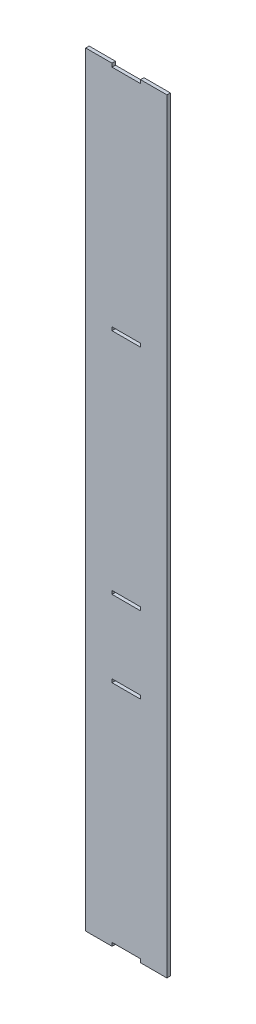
from build123d import *

# Parameters (mm, degrees)
SKETCH1_W           = 12.7
SKETCH1_H           = 1.524
BOSS_EXTRUDE1_DEPTH = 1.524


with BuildPart() as part:
    # Sketch1 → Boss-Extrude1 (new body)
    with BuildSketch(Plane.XY):
        Polygon((-6.35, 338.849599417), (-6.35, 337.325599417), (6.35, 337.325599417), (6.35, 338.849599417), (18.060084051, 338.849599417), (18.060084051, -1.524), (6.35, -1.524), (6.35, 0), (-6.35, 0), (-6.35, -1.524), (-18.060084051, -1.524), (-18.060084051, 338.849599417), align=None)
        with Locations((0, 236.487599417)):
            Rectangle(SKETCH1_W, SKETCH1_H, mode=Mode.SUBTRACT)
        with Locations((0, 134.887599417)):
            Rectangle(SKETCH1_W, SKETCH1_H, mode=Mode.SUBTRACT)
        with Locations((0, 100.838)):
            Rectangle(SKETCH1_W, SKETCH1_H, mode=Mode.SUBTRACT)
    extrude(amount=BOSS_EXTRUDE1_DEPTH)


solid = part.part
